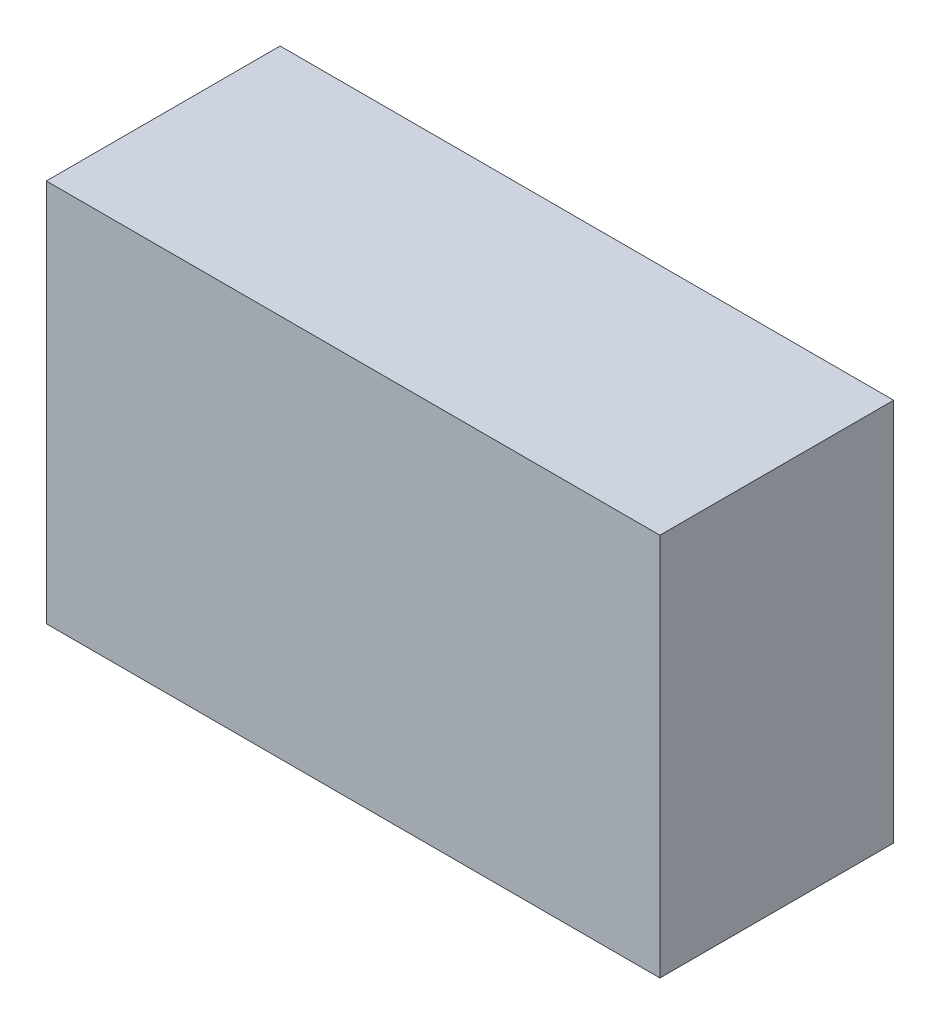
from build123d import *

# Parameters (mm, degrees)
SKETCH1_W               = 2
SKETCH1_H               = 1.25
COMPONENT_OUTLINE_DEPTH = 0.762


with BuildPart() as part:
    # Sketch1 → Component_Outline (new body)
    with BuildSketch(Plane.XY):
        with Locations((-0.778, -0.264)):
            Rectangle(SKETCH1_W, SKETCH1_H)
    extrude(amount=COMPONENT_OUTLINE_DEPTH)


solid = part.part
